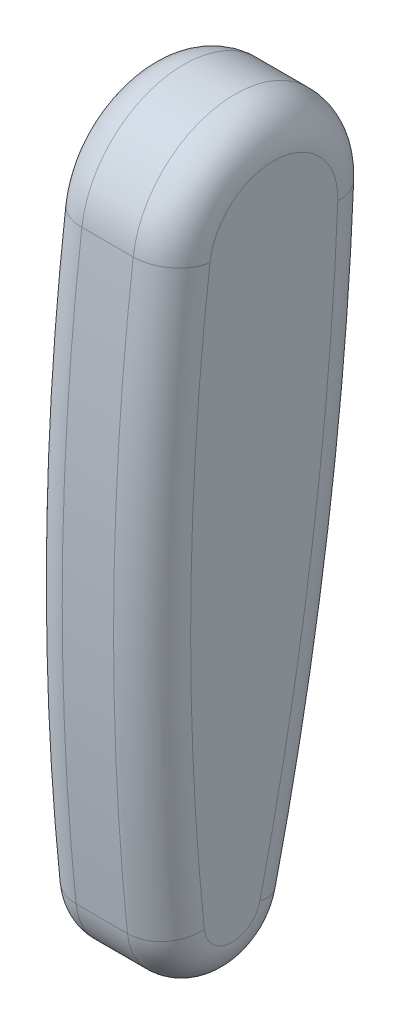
ISO-10303-21;
HEADER;
FILE_DESCRIPTION(('STEP AP214'),'2;1');
FILE_NAME('part.step','',(''),(''),'','','');
FILE_SCHEMA(('AUTOMOTIVE_DESIGN { 1 0 10303 214 1 1 1 1 }'));
ENDSEC;
DATA;
#1=APPLICATION_CONTEXT('core data for automotive mechanical design processes');
#2=APPLICATION_PROTOCOL_DEFINITION('international standard','automotive_design',2000,#1);
#3=PRODUCT_CONTEXT('',#1,'mechanical');
#4=PRODUCT('Part','Part','',(#3));
#5=PRODUCT_RELATED_PRODUCT_CATEGORY('part','',(#4));
#6=PRODUCT_DEFINITION_FORMATION('','',#4);
#7=PRODUCT_DEFINITION_CONTEXT('part definition',#1,'design');
#8=PRODUCT_DEFINITION('design','',#6,#7);
#9=PRODUCT_DEFINITION_SHAPE('','',#8);
#10=(LENGTH_UNIT() NAMED_UNIT(*) SI_UNIT(.MILLI.,.METRE.));
#11=(NAMED_UNIT(*) PLANE_ANGLE_UNIT() SI_UNIT($,.RADIAN.));
#12=(NAMED_UNIT(*) SI_UNIT($,.STERADIAN.) SOLID_ANGLE_UNIT());
#13=UNCERTAINTY_MEASURE_WITH_UNIT(LENGTH_MEASURE(1.E-05),#10,'distance_accuracy_value','');
#14=(GEOMETRIC_REPRESENTATION_CONTEXT(3) GLOBAL_UNCERTAINTY_ASSIGNED_CONTEXT((#13)) GLOBAL_UNIT_ASSIGNED_CONTEXT((#10,
#11,#12)) REPRESENTATION_CONTEXT('',''));
#15=CARTESIAN_POINT('',(0.,0.,0.));
#16=DIRECTION('',(0.,0.,1.));
#17=DIRECTION('',(1.,0.,0.));
#18=AXIS2_PLACEMENT_3D('',#15,#16,#17);
#19=CARTESIAN_POINT('',(222.25,-234.840307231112,-1250.38847130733));
#20=DIRECTION('',(1.,0.,0.));
#21=DIRECTION('',(0.,0.,-1.));
#22=AXIS2_PLACEMENT_3D('',#19,#20,#21);
#23=CYLINDRICAL_SURFACE('',#22,1270.);
#24=DIRECTION('',(1.,0.,0.));
#25=VECTOR('',#24,1.);
#26=CARTESIAN_POINT('',(222.25,-366.573375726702,12.7609255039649));
#27=LINE('',#26,#25);
#28=CARTESIAN_POINT('',(241.3,-366.573375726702,12.7609255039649));
#29=VERTEX_POINT('',#28);
#30=CARTESIAN_POINT('',(266.7,-366.573375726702,12.7609255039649));
#31=VERTEX_POINT('',#30);
#32=EDGE_CURVE('E141',#29,#31,#27,.T.);
#33=ORIENTED_EDGE('',*,*,#32,.T.);
#34=CARTESIAN_POINT('',(266.7,-234.840307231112,-1250.38847130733));
#35=DIRECTION('',(-1.,0.,0.));
#36=DIRECTION('',(0.,0.,1.));
#37=AXIS2_PLACEMENT_3D('',#34,#35,#36);
#38=CIRCLE('',#37,1270.);
#39=CARTESIAN_POINT('',(266.7,-78.2306079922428,9.91839692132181));
#40=VERTEX_POINT('',#39);
#41=EDGE_CURVE('E150',#31,#40,#38,.T.);
#42=ORIENTED_EDGE('',*,*,#41,.T.);
#43=DIRECTION('',(1.,0.,0.));
#44=VECTOR('',#43,1.);
#45=CARTESIAN_POINT('',(222.25,-78.2306079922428,9.91839692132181));
#46=LINE('',#45,#44);
#47=CARTESIAN_POINT('',(241.3,-78.2306079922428,9.91839692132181));
#48=VERTEX_POINT('',#47);
#49=EDGE_CURVE('E119',#48,#40,#46,.T.);
#50=ORIENTED_EDGE('',*,*,#49,.F.);
#51=CARTESIAN_POINT('',(241.3,-234.840307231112,-1250.38847130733));
#52=DIRECTION('',(-1.,0.,0.));
#53=DIRECTION('',(0.,0.,1.));
#54=AXIS2_PLACEMENT_3D('',#51,#52,#53);
#55=CIRCLE('',#54,1270.);
#56=EDGE_CURVE('E152',#48,#29,#55,.F.);
#57=ORIENTED_EDGE('',*,*,#56,.T.);
#58=EDGE_LOOP('',(#33,#42,#50,#57));
#59=FACE_BOUND('',#58,.T.);
#60=ADVANCED_FACE('F32',(#59),#23,.T.);
#61=CARTESIAN_POINT('',(222.25,-84.4949959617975,-40.4938778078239));
#62=DIRECTION('',(1.,0.,0.));
#63=DIRECTION('',(0.,0.,-1.));
#64=AXIS2_PLACEMENT_3D('',#61,#62,#63);
#65=CYLINDRICAL_SURFACE('',#64,50.7999999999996);
#66=ORIENTED_EDGE('',*,*,#49,.T.);
#67=CARTESIAN_POINT('',(266.7,-84.4949959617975,-40.4938778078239));
#68=DIRECTION('',(-1.,0.,0.));
#69=DIRECTION('',(0.,0.,1.));
#70=AXIS2_PLACEMENT_3D('',#67,#68,#69);
#71=CIRCLE('',#70,50.7999999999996);
#72=CARTESIAN_POINT('',(266.7,-86.6438502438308,-91.2484088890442));
#73=VERTEX_POINT('',#72);
#74=EDGE_CURVE('E118',#40,#73,#71,.T.);
#75=ORIENTED_EDGE('',*,*,#74,.T.);
#76=DIRECTION('',(1.,0.,0.));
#77=VECTOR('',#76,1.);
#78=CARTESIAN_POINT('',(222.25,-86.6438502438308,-91.2484088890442));
#79=LINE('',#78,#77);
#80=CARTESIAN_POINT('',(241.3,-86.6438502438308,-91.2484088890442));
#81=VERTEX_POINT('',#80);
#82=EDGE_CURVE('E101',#81,#73,#79,.T.);
#83=ORIENTED_EDGE('',*,*,#82,.F.);
#84=CARTESIAN_POINT('',(241.3,-84.4949959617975,-40.4938778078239));
#85=DIRECTION('',(-1.,0.,0.));
#86=DIRECTION('',(0.,0.,1.));
#87=AXIS2_PLACEMENT_3D('',#84,#85,#86);
#88=CIRCLE('',#87,50.7999999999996);
#89=EDGE_CURVE('E115',#81,#48,#88,.F.);
#90=ORIENTED_EDGE('',*,*,#89,.T.);
#91=EDGE_LOOP('',(#66,#75,#83,#90));
#92=FACE_BOUND('',#91,.T.);
#93=ADVANCED_FACE('F114',(#92),#65,.T.);
#94=CARTESIAN_POINT('',(222.25,-22.1782217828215,1431.38752354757));
#95=DIRECTION('',(1.,0.,0.));
#96=DIRECTION('',(0.,0.,-1.));
#97=AXIS2_PLACEMENT_3D('',#94,#95,#96);
#98=CYLINDRICAL_SURFACE('',#97,1524.);
#99=ORIENTED_EDGE('',*,*,#82,.T.);
#100=CARTESIAN_POINT('',(266.7,-22.1782217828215,1431.38752354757));
#101=DIRECTION('',(-1.,0.,0.));
#102=DIRECTION('',(0.,0.,1.));
#103=AXIS2_PLACEMENT_3D('',#100,#101,#102);
#104=CIRCLE('',#103,1524.);
#105=CARTESIAN_POINT('',(266.7,-370.699612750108,-52.2259166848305));
#106=VERTEX_POINT('',#105);
#107=EDGE_CURVE('E107',#73,#106,#104,.T.);
#108=ORIENTED_EDGE('',*,*,#107,.T.);
#109=DIRECTION('',(1.,0.,0.));
#110=VECTOR('',#109,1.);
#111=CARTESIAN_POINT('',(222.25,-370.699612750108,-52.2259166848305));
#112=LINE('',#111,#110);
#113=CARTESIAN_POINT('',(241.3,-370.699612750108,-52.2259166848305));
#114=VERTEX_POINT('',#113);
#115=EDGE_CURVE('E103',#114,#106,#112,.T.);
#116=ORIENTED_EDGE('',*,*,#115,.F.);
#117=CARTESIAN_POINT('',(241.3,-22.1782217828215,1431.38752354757));
#118=DIRECTION('',(-1.,0.,0.));
#119=DIRECTION('',(0.,0.,1.));
#120=AXIS2_PLACEMENT_3D('',#117,#118,#119);
#121=CIRCLE('',#120,1524.);
#122=EDGE_CURVE('E98',#114,#81,#121,.F.);
#123=ORIENTED_EDGE('',*,*,#122,.T.);
#124=EDGE_LOOP('',(#99,#108,#116,#123));
#125=FACE_BOUND('',#124,.T.);
#126=ADVANCED_FACE('F100',(#125),#98,.T.);
#127=CARTESIAN_POINT('',(222.25,-363.148315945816,-20.0809588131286));
#128=DIRECTION('',(1.,0.,0.));
#129=DIRECTION('',(0.,0.,-1.));
#130=AXIS2_PLACEMENT_3D('',#127,#128,#129);
#131=CYLINDRICAL_SURFACE('',#130,33.0199999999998);
#132=ORIENTED_EDGE('',*,*,#115,.T.);
#133=CARTESIAN_POINT('',(266.7,-363.148315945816,-20.0809588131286));
#134=DIRECTION('',(-1.,0.,0.));
#135=DIRECTION('',(0.,0.,1.));
#136=AXIS2_PLACEMENT_3D('',#133,#134,#135);
#137=CIRCLE('',#136,33.0199999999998);
#138=EDGE_CURVE('E154',#106,#31,#137,.T.);
#139=ORIENTED_EDGE('',*,*,#138,.T.);
#140=ORIENTED_EDGE('',*,*,#32,.F.);
#141=CARTESIAN_POINT('',(241.3,-363.148315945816,-20.0809588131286));
#142=DIRECTION('',(-1.,0.,0.));
#143=DIRECTION('',(0.,0.,1.));
#144=AXIS2_PLACEMENT_3D('',#141,#142,#143);
#145=CIRCLE('',#144,33.0199999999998);
#146=EDGE_CURVE('E156',#29,#114,#145,.F.);
#147=ORIENTED_EDGE('',*,*,#146,.T.);
#148=EDGE_LOOP('',(#132,#139,#140,#147));
#149=FACE_BOUND('',#148,.T.);
#150=ADVANCED_FACE('F194',(#149),#131,.T.);
#151=CARTESIAN_POINT('',(222.25,-159.667651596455,-645.441174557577));
#152=DIRECTION('',(-1.,0.,0.));
#153=DIRECTION('',(0.,0.,1.));
#154=AXIS2_PLACEMENT_3D('',#151,#152,#153);
#155=PLANE('',#154);
#156=CARTESIAN_POINT('',(222.25,-22.1782217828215,1431.38752354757));
#157=DIRECTION('',(-1.,0.,0.));
#158=DIRECTION('',(0.,0.,1.));
#159=AXIS2_PLACEMENT_3D('',#156,#157,#158);
#160=CIRCLE('',#159,1504.95);
#161=CARTESIAN_POINT('',(222.25,-85.8380298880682,-72.2154597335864));
#162=VERTEX_POINT('',#161);
#163=CARTESIAN_POINT('',(222.25,-366.343095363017,-33.6807486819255));
#164=VERTEX_POINT('',#163);
#165=EDGE_CURVE('E41',#162,#164,#160,.T.);
#166=ORIENTED_EDGE('',*,*,#165,.T.);
#167=CARTESIAN_POINT('',(222.25,-363.148315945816,-20.0809588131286));
#168=DIRECTION('',(-1.,0.,0.));
#169=DIRECTION('',(0.,0.,1.));
#170=AXIS2_PLACEMENT_3D('',#167,#168,#169);
#171=CIRCLE('',#170,13.9699999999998);
#172=CARTESIAN_POINT('',(222.25,-364.597379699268,-6.18631544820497));
#173=VERTEX_POINT('',#172);
#174=EDGE_CURVE('E11',#164,#173,#171,.T.);
#175=ORIENTED_EDGE('',*,*,#174,.T.);
#176=CARTESIAN_POINT('',(222.25,-234.840307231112,-1250.38847130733));
#177=DIRECTION('',(-1.,0.,0.));
#178=DIRECTION('',(0.,0.,1.));
#179=AXIS2_PLACEMENT_3D('',#176,#177,#178);
#180=CIRCLE('',#179,1250.95);
#181=CARTESIAN_POINT('',(222.25,-80.5797534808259,-8.98620610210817));
#182=VERTEX_POINT('',#181);
#183=EDGE_CURVE('E148',#173,#182,#180,.T.);
#184=ORIENTED_EDGE('',*,*,#183,.T.);
#185=CARTESIAN_POINT('',(222.25,-84.4949959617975,-40.4938778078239));
#186=DIRECTION('',(-1.,0.,0.));
#187=DIRECTION('',(0.,0.,1.));
#188=AXIS2_PLACEMENT_3D('',#185,#186,#187);
#189=CIRCLE('',#188,31.7499999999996);
#190=EDGE_CURVE('E52',#182,#162,#189,.T.);
#191=ORIENTED_EDGE('',*,*,#190,.T.);
#192=EDGE_LOOP('',(#166,#175,#184,#191));
#193=FACE_BOUND('',#192,.T.);
#194=ADVANCED_FACE('F200',(#193),#155,.T.);
#195=CARTESIAN_POINT('',(285.75,-159.667651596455,-645.441174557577));
#196=DIRECTION('',(-1.,0.,0.));
#197=DIRECTION('',(0.,0.,1.));
#198=AXIS2_PLACEMENT_3D('',#195,#196,#197);
#199=PLANE('',#198);
#200=CARTESIAN_POINT('',(285.75,-22.1782217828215,1431.38752354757));
#201=DIRECTION('',(-1.,0.,0.));
#202=DIRECTION('',(0.,0.,1.));
#203=AXIS2_PLACEMENT_3D('',#200,#201,#202);
#204=CIRCLE('',#203,1504.95);
#205=CARTESIAN_POINT('',(285.75,-366.343095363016,-33.6807486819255));
#206=VERTEX_POINT('',#205);
#207=CARTESIAN_POINT('',(285.75,-85.8380298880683,-72.2154597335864));
#208=VERTEX_POINT('',#207);
#209=EDGE_CURVE('E161',#206,#208,#204,.F.);
#210=ORIENTED_EDGE('',*,*,#209,.T.);
#211=CARTESIAN_POINT('',(285.75,-84.4949959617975,-40.4938778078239));
#212=DIRECTION('',(-1.,0.,0.));
#213=DIRECTION('',(0.,0.,1.));
#214=AXIS2_PLACEMENT_3D('',#211,#212,#213);
#215=CIRCLE('',#214,31.7499999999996);
#216=CARTESIAN_POINT('',(285.75,-80.5797534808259,-8.98620610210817));
#217=VERTEX_POINT('',#216);
#218=EDGE_CURVE('E108',#208,#217,#215,.F.);
#219=ORIENTED_EDGE('',*,*,#218,.T.);
#220=CARTESIAN_POINT('',(285.75,-234.840307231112,-1250.38847130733));
#221=DIRECTION('',(-1.,0.,0.));
#222=DIRECTION('',(0.,0.,1.));
#223=AXIS2_PLACEMENT_3D('',#220,#221,#222);
#224=CIRCLE('',#223,1250.95);
#225=CARTESIAN_POINT('',(285.75,-364.597379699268,-6.18631544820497));
#226=VERTEX_POINT('',#225);
#227=EDGE_CURVE('E165',#217,#226,#224,.F.);
#228=ORIENTED_EDGE('',*,*,#227,.T.);
#229=CARTESIAN_POINT('',(285.75,-363.148315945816,-20.0809588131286));
#230=DIRECTION('',(-1.,0.,0.));
#231=DIRECTION('',(0.,0.,1.));
#232=AXIS2_PLACEMENT_3D('',#229,#230,#231);
#233=CIRCLE('',#232,13.9699999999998);
#234=EDGE_CURVE('E163',#226,#206,#233,.F.);
#235=ORIENTED_EDGE('',*,*,#234,.T.);
#236=EDGE_LOOP('',(#210,#219,#228,#235));
#237=FACE_BOUND('',#236,.T.);
#238=ADVANCED_FACE('F202',(#237),#199,.F.);
#239=CARTESIAN_POINT('',(266.7,-363.148315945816,-20.0809588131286));
#240=DIRECTION('',(-1.,0.,0.));
#241=DIRECTION('',(0.,0.,1.));
#242=AXIS2_PLACEMENT_3D('',#239,#240,#241);
#243=DEGENERATE_TOROIDAL_SURFACE('',#242,13.9699999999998,19.05,.T.);
#244=CARTESIAN_POINT('',(266.7,-366.343095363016,-33.6807486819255));
#245=DIRECTION('',(0.,0.973499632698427,-0.228688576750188));
#246=DIRECTION('',(0.,0.228688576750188,0.973499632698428));
#247=AXIS2_PLACEMENT_3D('',#244,#245,#246);
#248=CIRCLE('',#247,19.05);
#249=EDGE_CURVE('E142',#206,#106,#248,.T.);
#250=ORIENTED_EDGE('',*,*,#249,.F.);
#251=ORIENTED_EDGE('',*,*,#234,.F.);
#252=CARTESIAN_POINT('',(266.7,-364.597379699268,-6.18631544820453));
#253=DIRECTION('',(0.,0.994605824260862,0.103726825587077));
#254=DIRECTION('',(0.,-0.103726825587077,0.994605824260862));
#255=AXIS2_PLACEMENT_3D('',#252,#253,#254);
#256=CIRCLE('',#255,19.05);
#257=EDGE_CURVE('E138',#31,#226,#256,.T.);
#258=ORIENTED_EDGE('',*,*,#257,.F.);
#259=ORIENTED_EDGE('',*,*,#138,.F.);
#260=EDGE_LOOP('',(#250,#251,#258,#259));
#261=FACE_BOUND('',#260,.T.);
#262=ADVANCED_FACE('F181',(#261),#243,.T.);
#263=CARTESIAN_POINT('',(266.7,-234.840307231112,-1250.38847130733));
#264=DIRECTION('',(-1.,0.,0.));
#265=DIRECTION('',(0.,0.,1.));
#266=AXIS2_PLACEMENT_3D('',#263,#264,#265);
#267=TOROIDAL_SURFACE('',#266,1250.95,19.05);
#268=ORIENTED_EDGE('',*,*,#257,.T.);
#269=ORIENTED_EDGE('',*,*,#227,.F.);
#270=CARTESIAN_POINT('',(266.7,-80.5797534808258,-8.98620610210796));
#271=DIRECTION('',(0.,0.992367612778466,-0.123314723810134));
#272=DIRECTION('',(0.,0.123314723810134,0.992367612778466));
#273=AXIS2_PLACEMENT_3D('',#270,#271,#272);
#274=CIRCLE('',#273,19.05);
#275=EDGE_CURVE('E129',#40,#217,#274,.T.);
#276=ORIENTED_EDGE('',*,*,#275,.F.);
#277=ORIENTED_EDGE('',*,*,#41,.F.);
#278=EDGE_LOOP('',(#268,#269,#276,#277));
#279=FACE_BOUND('',#278,.T.);
#280=ADVANCED_FACE('F185',(#279),#267,.T.);
#281=CARTESIAN_POINT('',(266.7,-22.1782217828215,1431.38752354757));
#282=DIRECTION('',(-1.,0.,0.));
#283=DIRECTION('',(0.,0.,1.));
#284=AXIS2_PLACEMENT_3D('',#281,#282,#283);
#285=TOROIDAL_SURFACE('',#284,1504.95,19.05);
#286=ORIENTED_EDGE('',*,*,#249,.T.);
#287=ORIENTED_EDGE('',*,*,#107,.F.);
#288=CARTESIAN_POINT('',(266.7,-85.8380298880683,-72.2154597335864));
#289=DIRECTION('',(0.,0.999104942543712,-0.0423002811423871));
#290=DIRECTION('',(0.,0.0423002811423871,0.999104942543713));
#291=AXIS2_PLACEMENT_3D('',#288,#289,#290);
#292=CIRCLE('',#291,19.05);
#293=EDGE_CURVE('E128',#208,#73,#292,.T.);
#294=ORIENTED_EDGE('',*,*,#293,.F.);
#295=ORIENTED_EDGE('',*,*,#209,.F.);
#296=EDGE_LOOP('',(#286,#287,#294,#295));
#297=FACE_BOUND('',#296,.T.);
#298=ADVANCED_FACE('F193',(#297),#285,.T.);
#299=CARTESIAN_POINT('',(266.7,-84.4949959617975,-40.4938778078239));
#300=DIRECTION('',(-1.,0.,0.));
#301=DIRECTION('',(0.,0.,1.));
#302=AXIS2_PLACEMENT_3D('',#299,#300,#301);
#303=TOROIDAL_SURFACE('',#302,31.7499999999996,19.05);
#304=ORIENTED_EDGE('',*,*,#275,.T.);
#305=ORIENTED_EDGE('',*,*,#218,.F.);
#306=ORIENTED_EDGE('',*,*,#293,.T.);
#307=ORIENTED_EDGE('',*,*,#74,.F.);
#308=EDGE_LOOP('',(#304,#305,#306,#307));
#309=FACE_BOUND('',#308,.T.);
#310=ADVANCED_FACE('F188',(#309),#303,.T.);
#311=CARTESIAN_POINT('',(241.3,-84.4949959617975,-40.4938778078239));
#312=DIRECTION('',(-1.,0.,0.));
#313=DIRECTION('',(0.,0.,1.));
#314=AXIS2_PLACEMENT_3D('',#311,#312,#313);
#315=TOROIDAL_SURFACE('',#314,31.7499999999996,19.05);
#316=CARTESIAN_POINT('',(241.3,-80.5797534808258,-8.98620610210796));
#317=DIRECTION('',(0.,-0.992367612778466,0.123314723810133));
#318=DIRECTION('',(0.,-0.123314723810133,-0.992367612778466));
#319=AXIS2_PLACEMENT_3D('',#316,#317,#318);
#320=CIRCLE('',#319,19.05);
#321=EDGE_CURVE('E124',#48,#182,#320,.T.);
#322=ORIENTED_EDGE('',*,*,#321,.F.);
#323=ORIENTED_EDGE('',*,*,#89,.F.);
#324=CARTESIAN_POINT('',(241.3,-85.8380298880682,-72.2154597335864));
#325=DIRECTION('',(0.,-0.999104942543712,0.0423002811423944));
#326=DIRECTION('',(0.,-0.0423002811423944,-0.999104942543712));
#327=AXIS2_PLACEMENT_3D('',#324,#325,#326);
#328=CIRCLE('',#327,19.05);
#329=EDGE_CURVE('E36',#162,#81,#328,.T.);
#330=ORIENTED_EDGE('',*,*,#329,.F.);
#331=ORIENTED_EDGE('',*,*,#190,.F.);
#332=EDGE_LOOP('',(#322,#323,#330,#331));
#333=FACE_BOUND('',#332,.T.);
#334=ADVANCED_FACE('F34',(#333),#315,.T.);
#335=CARTESIAN_POINT('',(241.3,-22.1782217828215,1431.38752354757));
#336=DIRECTION('',(-1.,0.,0.));
#337=DIRECTION('',(0.,0.,1.));
#338=AXIS2_PLACEMENT_3D('',#335,#336,#337);
#339=TOROIDAL_SURFACE('',#338,1504.95,19.05);
#340=ORIENTED_EDGE('',*,*,#329,.T.);
#341=ORIENTED_EDGE('',*,*,#122,.F.);
#342=CARTESIAN_POINT('',(241.3,-366.343095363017,-33.6807486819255));
#343=DIRECTION('',(0.,-0.973499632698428,0.228688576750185));
#344=DIRECTION('',(0.,-0.228688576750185,-0.973499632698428));
#345=AXIS2_PLACEMENT_3D('',#342,#343,#344);
#346=CIRCLE('',#345,19.05);
#347=EDGE_CURVE('E131',#164,#114,#346,.T.);
#348=ORIENTED_EDGE('',*,*,#347,.F.);
#349=ORIENTED_EDGE('',*,*,#165,.F.);
#350=EDGE_LOOP('',(#340,#341,#348,#349));
#351=FACE_BOUND('',#350,.T.);
#352=ADVANCED_FACE('F127',(#351),#339,.T.);
#353=CARTESIAN_POINT('',(241.3,-234.840307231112,-1250.38847130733));
#354=DIRECTION('',(-1.,0.,0.));
#355=DIRECTION('',(0.,0.,1.));
#356=AXIS2_PLACEMENT_3D('',#353,#354,#355);
#357=TOROIDAL_SURFACE('',#356,1250.95,19.05);
#358=ORIENTED_EDGE('',*,*,#321,.T.);
#359=ORIENTED_EDGE('',*,*,#183,.F.);
#360=CARTESIAN_POINT('',(241.3,-364.597379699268,-6.18631544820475));
#361=DIRECTION('',(0.,-0.994605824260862,-0.103726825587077));
#362=DIRECTION('',(0.,0.103726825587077,-0.994605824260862));
#363=AXIS2_PLACEMENT_3D('',#360,#361,#362);
#364=CIRCLE('',#363,19.05);
#365=EDGE_CURVE('E134',#29,#173,#364,.T.);
#366=ORIENTED_EDGE('',*,*,#365,.F.);
#367=ORIENTED_EDGE('',*,*,#56,.F.);
#368=EDGE_LOOP('',(#358,#359,#366,#367));
#369=FACE_BOUND('',#368,.T.);
#370=ADVANCED_FACE('F199',(#369),#357,.T.);
#371=CARTESIAN_POINT('',(241.3,-363.148315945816,-20.0809588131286));
#372=DIRECTION('',(-1.,0.,0.));
#373=DIRECTION('',(0.,0.,1.));
#374=AXIS2_PLACEMENT_3D('',#371,#372,#373);
#375=DEGENERATE_TOROIDAL_SURFACE('',#374,13.9699999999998,19.05,.T.);
#376=ORIENTED_EDGE('',*,*,#347,.T.);
#377=ORIENTED_EDGE('',*,*,#146,.F.);
#378=ORIENTED_EDGE('',*,*,#365,.T.);
#379=ORIENTED_EDGE('',*,*,#174,.F.);
#380=EDGE_LOOP('',(#376,#377,#378,#379));
#381=FACE_BOUND('',#380,.T.);
#382=ADVANCED_FACE('F197',(#381),#375,.T.);
#383=CLOSED_SHELL('',(#60,#93,#126,#150,#194,#238,#262,#280,#298,#310,#334,#352,#370,#382));
#384=MANIFOLD_SOLID_BREP('B2',#383);
#385=ADVANCED_BREP_SHAPE_REPRESENTATION('',(#18,#384),#14);
#386=SHAPE_DEFINITION_REPRESENTATION(#9,#385);
ENDSEC;
END-ISO-10303-21;
